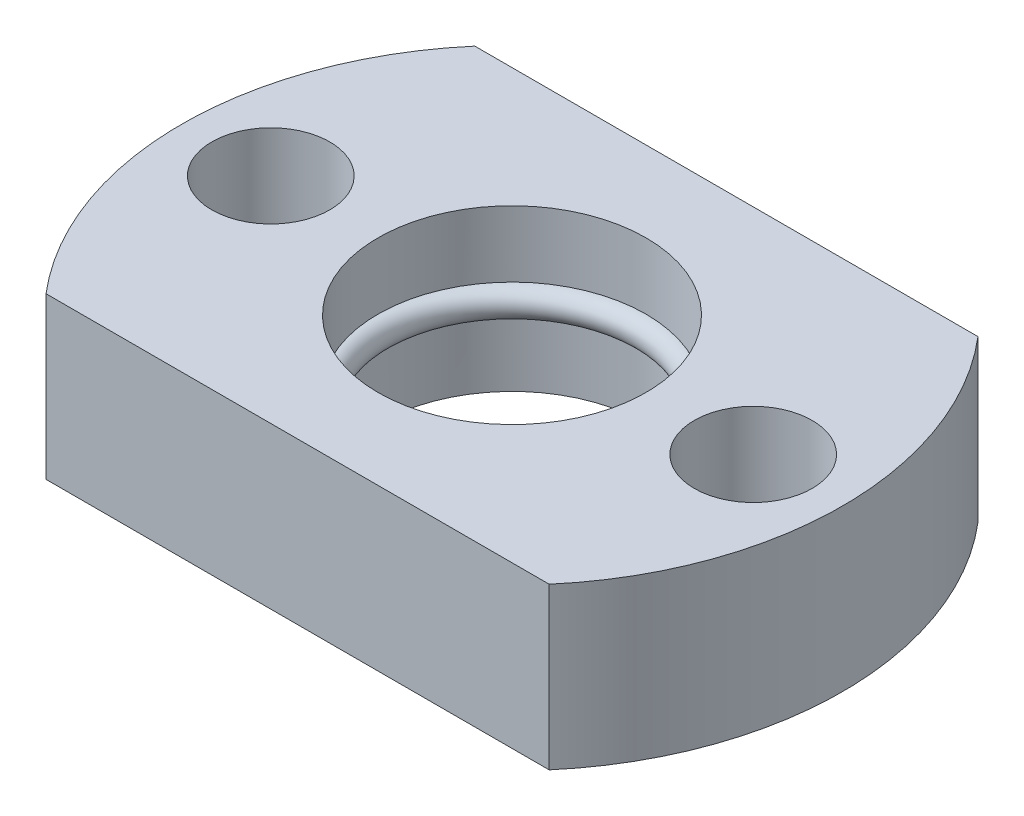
ISO-10303-21;
HEADER;
FILE_DESCRIPTION(('STEP AP214'),'2;1');
FILE_NAME('part.step','',(''),(''),'','','');
FILE_SCHEMA(('AUTOMOTIVE_DESIGN { 1 0 10303 214 1 1 1 1 }'));
ENDSEC;
DATA;
#1=APPLICATION_CONTEXT('core data for automotive mechanical design processes');
#2=APPLICATION_PROTOCOL_DEFINITION('international standard','automotive_design',2000,#1);
#3=PRODUCT_CONTEXT('',#1,'mechanical');
#4=PRODUCT('Part','Part','',(#3));
#5=PRODUCT_RELATED_PRODUCT_CATEGORY('part','',(#4));
#6=PRODUCT_DEFINITION_FORMATION('','',#4);
#7=PRODUCT_DEFINITION_CONTEXT('part definition',#1,'design');
#8=PRODUCT_DEFINITION('design','',#6,#7);
#9=PRODUCT_DEFINITION_SHAPE('','',#8);
#10=(LENGTH_UNIT() NAMED_UNIT(*) SI_UNIT(.MILLI.,.METRE.));
#11=(NAMED_UNIT(*) PLANE_ANGLE_UNIT() SI_UNIT($,.RADIAN.));
#12=(NAMED_UNIT(*) SI_UNIT($,.STERADIAN.) SOLID_ANGLE_UNIT());
#13=UNCERTAINTY_MEASURE_WITH_UNIT(LENGTH_MEASURE(1.E-05),#10,'distance_accuracy_value','');
#14=(GEOMETRIC_REPRESENTATION_CONTEXT(3) GLOBAL_UNCERTAINTY_ASSIGNED_CONTEXT((#13)) GLOBAL_UNIT_ASSIGNED_CONTEXT((#10,
#11,#12)) REPRESENTATION_CONTEXT('',''));
#15=CARTESIAN_POINT('',(0.,0.,0.));
#16=DIRECTION('',(0.,0.,1.));
#17=DIRECTION('',(1.,0.,0.));
#18=AXIS2_PLACEMENT_3D('',#15,#16,#17);
#19=CARTESIAN_POINT('',(0.,4.5,0.));
#20=DIRECTION('',(0.,-1.,0.));
#21=DIRECTION('',(0.,0.,-1.));
#22=AXIS2_PLACEMENT_3D('',#19,#20,#21);
#23=CYLINDRICAL_SURFACE('',#22,7.5);
#24=CARTESIAN_POINT('',(0.,-4.5,0.));
#25=DIRECTION('',(0.,1.,0.));
#26=DIRECTION('',(0.,0.,1.));
#27=AXIS2_PLACEMENT_3D('',#24,#25,#26);
#28=CIRCLE('',#27,7.5);
#29=CARTESIAN_POINT('',(0.,-4.5,7.5));
#30=VERTEX_POINT('',#29);
#31=EDGE_CURVE('E133',#30,#30,#28,.T.);
#32=ORIENTED_EDGE('',*,*,#31,.F.);
#33=EDGE_LOOP('',(#32));
#34=FACE_BOUND('',#33,.T.);
#35=CARTESIAN_POINT('',(0.,-0.800000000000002,0.));
#36=DIRECTION('',(0.,1.,0.));
#37=DIRECTION('',(0.,0.,1.));
#38=AXIS2_PLACEMENT_3D('',#35,#36,#37);
#39=CIRCLE('',#38,7.5);
#40=CARTESIAN_POINT('',(0.,-0.800000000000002,7.5));
#41=VERTEX_POINT('',#40);
#42=EDGE_CURVE('E41',#41,#41,#39,.T.);
#43=ORIENTED_EDGE('',*,*,#42,.T.);
#44=EDGE_LOOP('',(#43));
#45=FACE_BOUND('',#44,.T.);
#46=ADVANCED_FACE('F37',(#34,#45),#23,.F.);
#47=CARTESIAN_POINT('',(0.,4.5,0.));
#48=DIRECTION('',(0.,1.,0.));
#49=DIRECTION('',(0.,0.,1.));
#50=AXIS2_PLACEMENT_3D('',#47,#48,#49);
#51=CIRCLE('',#50,7.5);
#52=CARTESIAN_POINT('',(0.,4.5,7.5));
#53=VERTEX_POINT('',#52);
#54=EDGE_CURVE('E108',#53,#53,#51,.T.);
#55=ORIENTED_EDGE('',*,*,#54,.T.);
#56=EDGE_LOOP('',(#55));
#57=FACE_BOUND('',#56,.T.);
#58=CARTESIAN_POINT('',(0.,0.8,0.));
#59=DIRECTION('',(0.,-1.,0.));
#60=DIRECTION('',(0.,0.,-1.));
#61=AXIS2_PLACEMENT_3D('',#58,#59,#60);
#62=CIRCLE('',#61,7.5);
#63=CARTESIAN_POINT('',(0.,0.8,-7.5));
#64=VERTEX_POINT('',#63);
#65=EDGE_CURVE('E113',#64,#64,#62,.T.);
#66=ORIENTED_EDGE('',*,*,#65,.T.);
#67=EDGE_LOOP('',(#66));
#68=FACE_BOUND('',#67,.T.);
#69=ADVANCED_FACE('F145',(#57,#68),#23,.F.);
#70=CARTESIAN_POINT('',(0.,4.5,0.));
#71=DIRECTION('',(0.,1.,0.));
#72=DIRECTION('',(0.,0.,1.));
#73=AXIS2_PLACEMENT_3D('',#70,#71,#72);
#74=PLANE('',#73);
#75=CARTESIAN_POINT('',(-13.5,4.5,0.));
#76=DIRECTION('',(0.,1.,0.));
#77=DIRECTION('',(0.,0.,1.));
#78=AXIS2_PLACEMENT_3D('',#75,#76,#77);
#79=CIRCLE('',#78,3.3);
#80=CARTESIAN_POINT('',(-13.5,4.5,3.3));
#81=VERTEX_POINT('',#80);
#82=EDGE_CURVE('E130',#81,#81,#79,.T.);
#83=ORIENTED_EDGE('',*,*,#82,.F.);
#84=EDGE_LOOP('',(#83));
#85=FACE_BOUND('',#84,.T.);
#86=CARTESIAN_POINT('',(0.,4.5,0.));
#87=DIRECTION('',(0.,1.,0.));
#88=DIRECTION('',(0.,0.,1.));
#89=AXIS2_PLACEMENT_3D('',#86,#87,#88);
#90=CIRCLE('',#89,18.5);
#91=CARTESIAN_POINT('',(-14.0801278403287,4.5,-12.));
#92=VERTEX_POINT('',#91);
#93=CARTESIAN_POINT('',(-14.0801278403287,4.5,12.));
#94=VERTEX_POINT('',#93);
#95=EDGE_CURVE('E92',#92,#94,#90,.T.);
#96=ORIENTED_EDGE('',*,*,#95,.T.);
#97=DIRECTION('',(1.,0.,0.));
#98=VECTOR('',#97,1.);
#99=CARTESIAN_POINT('',(-14.0801278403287,4.5,12.));
#100=LINE('',#99,#98);
#101=CARTESIAN_POINT('',(14.0801278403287,4.5,12.));
#102=VERTEX_POINT('',#101);
#103=EDGE_CURVE('E86',#94,#102,#100,.T.);
#104=ORIENTED_EDGE('',*,*,#103,.T.);
#105=CARTESIAN_POINT('',(0.,4.5,0.));
#106=DIRECTION('',(0.,1.,0.));
#107=DIRECTION('',(0.,0.,1.));
#108=AXIS2_PLACEMENT_3D('',#105,#106,#107);
#109=CIRCLE('',#108,18.5);
#110=CARTESIAN_POINT('',(14.0801278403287,4.5,-12.));
#111=VERTEX_POINT('',#110);
#112=EDGE_CURVE('E90',#102,#111,#109,.T.);
#113=ORIENTED_EDGE('',*,*,#112,.T.);
#114=DIRECTION('',(-1.,0.,0.));
#115=VECTOR('',#114,1.);
#116=CARTESIAN_POINT('',(-14.0801278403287,4.5,-12.));
#117=LINE('',#116,#115);
#118=EDGE_CURVE('E56',#111,#92,#117,.T.);
#119=ORIENTED_EDGE('',*,*,#118,.T.);
#120=EDGE_LOOP('',(#96,#104,#113,#119));
#121=FACE_BOUND('',#120,.T.);
#122=ORIENTED_EDGE('',*,*,#54,.F.);
#123=EDGE_LOOP('',(#122));
#124=FACE_BOUND('',#123,.T.);
#125=CARTESIAN_POINT('',(13.5,4.5,0.));
#126=DIRECTION('',(0.,1.,0.));
#127=DIRECTION('',(0.,0.,1.));
#128=AXIS2_PLACEMENT_3D('',#125,#126,#127);
#129=CIRCLE('',#128,3.3);
#130=CARTESIAN_POINT('',(13.5,4.5,3.29999999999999));
#131=VERTEX_POINT('',#130);
#132=EDGE_CURVE('E122',#131,#131,#129,.T.);
#133=ORIENTED_EDGE('',*,*,#132,.F.);
#134=EDGE_LOOP('',(#133));
#135=FACE_BOUND('',#134,.T.);
#136=ADVANCED_FACE('F87',(#85,#121,#124,#135),#74,.T.);
#137=CARTESIAN_POINT('',(0.,-4.5,0.));
#138=DIRECTION('',(0.,1.,0.));
#139=DIRECTION('',(0.,0.,1.));
#140=AXIS2_PLACEMENT_3D('',#137,#138,#139);
#141=PLANE('',#140);
#142=CARTESIAN_POINT('',(0.,-4.5,0.));
#143=DIRECTION('',(0.,1.,0.));
#144=DIRECTION('',(0.,0.,1.));
#145=AXIS2_PLACEMENT_3D('',#142,#143,#144);
#146=CIRCLE('',#145,18.5);
#147=CARTESIAN_POINT('',(-14.0801278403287,-4.5,-12.));
#148=VERTEX_POINT('',#147);
#149=CARTESIAN_POINT('',(-14.0801278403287,-4.5,12.));
#150=VERTEX_POINT('',#149);
#151=EDGE_CURVE('E105',#148,#150,#146,.T.);
#152=ORIENTED_EDGE('',*,*,#151,.F.);
#153=DIRECTION('',(-1.,0.,0.));
#154=VECTOR('',#153,1.);
#155=CARTESIAN_POINT('',(-14.0801278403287,-4.5,-12.));
#156=LINE('',#155,#154);
#157=CARTESIAN_POINT('',(14.0801278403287,-4.5,-12.));
#158=VERTEX_POINT('',#157);
#159=EDGE_CURVE('E79',#158,#148,#156,.T.);
#160=ORIENTED_EDGE('',*,*,#159,.F.);
#161=CARTESIAN_POINT('',(0.,-4.5,0.));
#162=DIRECTION('',(0.,1.,0.));
#163=DIRECTION('',(0.,0.,1.));
#164=AXIS2_PLACEMENT_3D('',#161,#162,#163);
#165=CIRCLE('',#164,18.5);
#166=CARTESIAN_POINT('',(14.0801278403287,-4.5,12.));
#167=VERTEX_POINT('',#166);
#168=EDGE_CURVE('E73',#167,#158,#165,.T.);
#169=ORIENTED_EDGE('',*,*,#168,.F.);
#170=DIRECTION('',(1.,0.,0.));
#171=VECTOR('',#170,1.);
#172=CARTESIAN_POINT('',(-14.0801278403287,-4.5,12.));
#173=LINE('',#172,#171);
#174=EDGE_CURVE('E96',#150,#167,#173,.T.);
#175=ORIENTED_EDGE('',*,*,#174,.F.);
#176=EDGE_LOOP('',(#152,#160,#169,#175));
#177=FACE_BOUND('',#176,.T.);
#178=ORIENTED_EDGE('',*,*,#31,.T.);
#179=EDGE_LOOP('',(#178));
#180=FACE_BOUND('',#179,.T.);
#181=CARTESIAN_POINT('',(-13.5,-4.5,0.));
#182=DIRECTION('',(0.,1.,0.));
#183=DIRECTION('',(0.,0.,1.));
#184=AXIS2_PLACEMENT_3D('',#181,#182,#183);
#185=CIRCLE('',#184,3.3);
#186=CARTESIAN_POINT('',(-13.5,-4.5,3.3));
#187=VERTEX_POINT('',#186);
#188=EDGE_CURVE('E127',#187,#187,#185,.T.);
#189=ORIENTED_EDGE('',*,*,#188,.T.);
#190=EDGE_LOOP('',(#189));
#191=FACE_BOUND('',#190,.T.);
#192=CARTESIAN_POINT('',(13.5,-4.5,0.));
#193=DIRECTION('',(0.,1.,0.));
#194=DIRECTION('',(0.,0.,1.));
#195=AXIS2_PLACEMENT_3D('',#192,#193,#194);
#196=CIRCLE('',#195,3.3);
#197=CARTESIAN_POINT('',(13.5,-4.5,3.29999999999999));
#198=VERTEX_POINT('',#197);
#199=EDGE_CURVE('E118',#198,#198,#196,.T.);
#200=ORIENTED_EDGE('',*,*,#199,.T.);
#201=EDGE_LOOP('',(#200));
#202=FACE_BOUND('',#201,.T.);
#203=ADVANCED_FACE('F141',(#177,#180,#191,#202),#141,.F.);
#204=CARTESIAN_POINT('',(0.,4.5,0.));
#205=DIRECTION('',(0.,-1.,0.));
#206=DIRECTION('',(0.,0.,-1.));
#207=AXIS2_PLACEMENT_3D('',#204,#205,#206);
#208=CYLINDRICAL_SURFACE('',#207,18.5);
#209=ORIENTED_EDGE('',*,*,#151,.T.);
#210=DIRECTION('',(0.,-1.,0.));
#211=VECTOR('',#210,1.);
#212=CARTESIAN_POINT('',(-14.0801278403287,4.5,12.));
#213=LINE('',#212,#211);
#214=EDGE_CURVE('E11',#94,#150,#213,.T.);
#215=ORIENTED_EDGE('',*,*,#214,.F.);
#216=ORIENTED_EDGE('',*,*,#95,.F.);
#217=DIRECTION('',(0.,-1.,0.));
#218=VECTOR('',#217,1.);
#219=CARTESIAN_POINT('',(-14.0801278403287,4.5,-12.));
#220=LINE('',#219,#218);
#221=EDGE_CURVE('E101',#92,#148,#220,.T.);
#222=ORIENTED_EDGE('',*,*,#221,.T.);
#223=EDGE_LOOP('',(#209,#215,#216,#222));
#224=FACE_BOUND('',#223,.T.);
#225=ADVANCED_FACE('F39',(#224),#208,.T.);
#226=CARTESIAN_POINT('',(-14.0801278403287,4.5,12.));
#227=DIRECTION('',(0.,0.,-1.));
#228=DIRECTION('',(-1.,0.,0.));
#229=AXIS2_PLACEMENT_3D('',#226,#227,#228);
#230=PLANE('',#229);
#231=ORIENTED_EDGE('',*,*,#174,.T.);
#232=DIRECTION('',(0.,-1.,0.));
#233=VECTOR('',#232,1.);
#234=CARTESIAN_POINT('',(14.0801278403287,4.5,12.));
#235=LINE('',#234,#233);
#236=EDGE_CURVE('E47',#102,#167,#235,.T.);
#237=ORIENTED_EDGE('',*,*,#236,.F.);
#238=ORIENTED_EDGE('',*,*,#103,.F.);
#239=ORIENTED_EDGE('',*,*,#214,.T.);
#240=EDGE_LOOP('',(#231,#237,#238,#239));
#241=FACE_BOUND('',#240,.T.);
#242=ADVANCED_FACE('F95',(#241),#230,.F.);
#243=CARTESIAN_POINT('',(0.,4.5,0.));
#244=DIRECTION('',(0.,-1.,0.));
#245=DIRECTION('',(0.,0.,-1.));
#246=AXIS2_PLACEMENT_3D('',#243,#244,#245);
#247=CYLINDRICAL_SURFACE('',#246,18.5);
#248=ORIENTED_EDGE('',*,*,#168,.T.);
#249=DIRECTION('',(0.,-1.,0.));
#250=VECTOR('',#249,1.);
#251=CARTESIAN_POINT('',(14.0801278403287,4.5,-12.));
#252=LINE('',#251,#250);
#253=EDGE_CURVE('E97',#111,#158,#252,.T.);
#254=ORIENTED_EDGE('',*,*,#253,.F.);
#255=ORIENTED_EDGE('',*,*,#112,.F.);
#256=ORIENTED_EDGE('',*,*,#236,.T.);
#257=EDGE_LOOP('',(#248,#254,#255,#256));
#258=FACE_BOUND('',#257,.T.);
#259=ADVANCED_FACE('F99',(#258),#247,.T.);
#260=CARTESIAN_POINT('',(-14.0801278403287,4.5,-12.));
#261=DIRECTION('',(0.,0.,1.));
#262=DIRECTION('',(1.,0.,0.));
#263=AXIS2_PLACEMENT_3D('',#260,#261,#262);
#264=PLANE('',#263);
#265=ORIENTED_EDGE('',*,*,#159,.T.);
#266=ORIENTED_EDGE('',*,*,#221,.F.);
#267=ORIENTED_EDGE('',*,*,#118,.F.);
#268=ORIENTED_EDGE('',*,*,#253,.T.);
#269=EDGE_LOOP('',(#265,#266,#267,#268));
#270=FACE_BOUND('',#269,.T.);
#271=ADVANCED_FACE('F161',(#270),#264,.F.);
#272=CARTESIAN_POINT('',(-13.5,4.5,0.));
#273=DIRECTION('',(0.,-1.,0.));
#274=DIRECTION('',(0.,0.,-1.));
#275=AXIS2_PLACEMENT_3D('',#272,#273,#274);
#276=CYLINDRICAL_SURFACE('',#275,3.3);
#277=ORIENTED_EDGE('',*,*,#82,.T.);
#278=EDGE_LOOP('',(#277));
#279=FACE_BOUND('',#278,.T.);
#280=ORIENTED_EDGE('',*,*,#188,.F.);
#281=EDGE_LOOP('',(#280));
#282=FACE_BOUND('',#281,.T.);
#283=ADVANCED_FACE('F153',(#279,#282),#276,.F.);
#284=CARTESIAN_POINT('',(13.5,4.5,0.));
#285=DIRECTION('',(0.,-1.,0.));
#286=DIRECTION('',(0.,0.,-1.));
#287=AXIS2_PLACEMENT_3D('',#284,#285,#286);
#288=CYLINDRICAL_SURFACE('',#287,3.3);
#289=ORIENTED_EDGE('',*,*,#132,.T.);
#290=EDGE_LOOP('',(#289));
#291=FACE_BOUND('',#290,.T.);
#292=ORIENTED_EDGE('',*,*,#199,.F.);
#293=EDGE_LOOP('',(#292));
#294=FACE_BOUND('',#293,.T.);
#295=ADVANCED_FACE('F199',(#291,#294),#288,.F.);
#296=CARTESIAN_POINT('',(0.,0.,0.));
#297=DIRECTION('',(0.,-1.,0.));
#298=DIRECTION('',(0.,0.,-1.));
#299=AXIS2_PLACEMENT_3D('',#296,#297,#298);
#300=TOROIDAL_SURFACE('',#299,7.5,0.800000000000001);
#301=ORIENTED_EDGE('',*,*,#65,.F.);
#302=EDGE_LOOP('',(#301));
#303=FACE_BOUND('',#302,.T.);
#304=ORIENTED_EDGE('',*,*,#42,.F.);
#305=EDGE_LOOP('',(#304));
#306=FACE_BOUND('',#305,.T.);
#307=ADVANCED_FACE('F194',(#303,#306),#300,.T.);
#308=CLOSED_SHELL('',(#46,#69,#136,#203,#225,#242,#259,#271,#283,#295,#307));
#309=MANIFOLD_SOLID_BREP('B2',#308);
#310=ADVANCED_BREP_SHAPE_REPRESENTATION('',(#18,#309),#14);
#311=SHAPE_DEFINITION_REPRESENTATION(#9,#310);
ENDSEC;
END-ISO-10303-21;
